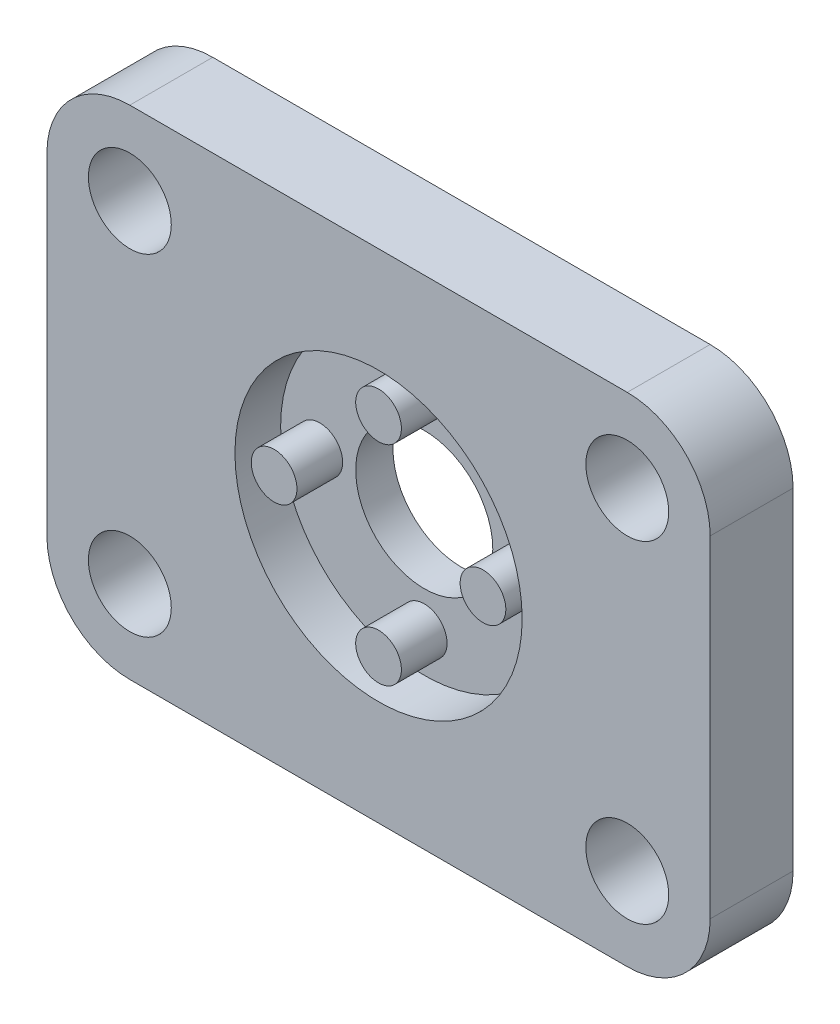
ISO-10303-21;
HEADER;
FILE_DESCRIPTION(('STEP AP214'),'2;1');
FILE_NAME('part.step','',(''),(''),'','','');
FILE_SCHEMA(('AUTOMOTIVE_DESIGN { 1 0 10303 214 1 1 1 1 }'));
ENDSEC;
DATA;
#1=APPLICATION_CONTEXT('core data for automotive mechanical design processes');
#2=APPLICATION_PROTOCOL_DEFINITION('international standard','automotive_design',2000,#1);
#3=PRODUCT_CONTEXT('',#1,'mechanical');
#4=PRODUCT('Part','Part','',(#3));
#5=PRODUCT_RELATED_PRODUCT_CATEGORY('part','',(#4));
#6=PRODUCT_DEFINITION_FORMATION('','',#4);
#7=PRODUCT_DEFINITION_CONTEXT('part definition',#1,'design');
#8=PRODUCT_DEFINITION('design','',#6,#7);
#9=PRODUCT_DEFINITION_SHAPE('','',#8);
#10=(LENGTH_UNIT() NAMED_UNIT(*) SI_UNIT(.MILLI.,.METRE.));
#11=(NAMED_UNIT(*) PLANE_ANGLE_UNIT() SI_UNIT($,.RADIAN.));
#12=(NAMED_UNIT(*) SI_UNIT($,.STERADIAN.) SOLID_ANGLE_UNIT());
#13=UNCERTAINTY_MEASURE_WITH_UNIT(LENGTH_MEASURE(1.E-05),#10,'distance_accuracy_value','');
#14=(GEOMETRIC_REPRESENTATION_CONTEXT(3) GLOBAL_UNCERTAINTY_ASSIGNED_CONTEXT((#13)) GLOBAL_UNIT_ASSIGNED_CONTEXT((#10,
#11,#12)) REPRESENTATION_CONTEXT('',''));
#15=CARTESIAN_POINT('',(0.,0.,0.));
#16=DIRECTION('',(0.,0.,1.));
#17=DIRECTION('',(1.,0.,0.));
#18=AXIS2_PLACEMENT_3D('',#15,#16,#17);
#19=CARTESIAN_POINT('',(0.,0.,6.35));
#20=DIRECTION('',(1.,0.,0.));
#21=DIRECTION('',(0.,0.,-1.));
#22=AXIS2_PLACEMENT_3D('',#19,#20,#21);
#23=PLANE('',#22);
#24=DIRECTION('',(0.,-1.,0.));
#25=VECTOR('',#24,1.);
#26=CARTESIAN_POINT('',(0.,0.,0.));
#27=LINE('',#26,#25);
#28=CARTESIAN_POINT('',(0.,31.75,0.));
#29=VERTEX_POINT('',#28);
#30=CARTESIAN_POINT('',(0.,6.35,0.));
#31=VERTEX_POINT('',#30);
#32=EDGE_CURVE('E169',#29,#31,#27,.T.);
#33=ORIENTED_EDGE('',*,*,#32,.T.);
#34=DIRECTION('',(0.,0.,-1.));
#35=VECTOR('',#34,1.);
#36=CARTESIAN_POINT('',(0.,6.35,6.35));
#37=LINE('',#36,#35);
#38=CARTESIAN_POINT('',(0.,6.35,6.35));
#39=VERTEX_POINT('',#38);
#40=EDGE_CURVE('E11',#31,#39,#37,.F.);
#41=ORIENTED_EDGE('',*,*,#40,.T.);
#42=DIRECTION('',(0.,-1.,0.));
#43=VECTOR('',#42,1.);
#44=CARTESIAN_POINT('',(0.,0.,6.35));
#45=LINE('',#44,#43);
#46=CARTESIAN_POINT('',(0.,31.75,6.35));
#47=VERTEX_POINT('',#46);
#48=EDGE_CURVE('E133',#47,#39,#45,.T.);
#49=ORIENTED_EDGE('',*,*,#48,.F.);
#50=DIRECTION('',(0.,0.,-1.));
#51=VECTOR('',#50,1.);
#52=CARTESIAN_POINT('',(0.,31.75,6.35));
#53=LINE('',#52,#51);
#54=EDGE_CURVE('E50',#47,#29,#53,.T.);
#55=ORIENTED_EDGE('',*,*,#54,.T.);
#56=EDGE_LOOP('',(#33,#41,#49,#55));
#57=FACE_BOUND('',#56,.T.);
#58=ADVANCED_FACE('F39',(#57),#23,.F.);
#59=CARTESIAN_POINT('',(0.,0.,6.35));
#60=DIRECTION('',(0.,1.,0.));
#61=DIRECTION('',(0.,0.,1.));
#62=AXIS2_PLACEMENT_3D('',#59,#60,#61);
#63=PLANE('',#62);
#64=DIRECTION('',(1.,0.,0.));
#65=VECTOR('',#64,1.);
#66=CARTESIAN_POINT('',(0.,0.,0.));
#67=LINE('',#66,#65);
#68=CARTESIAN_POINT('',(6.35,0.,0.));
#69=VERTEX_POINT('',#68);
#70=CARTESIAN_POINT('',(44.45,0.,0.));
#71=VERTEX_POINT('',#70);
#72=EDGE_CURVE('E136',#69,#71,#67,.T.);
#73=ORIENTED_EDGE('',*,*,#72,.T.);
#74=DIRECTION('',(0.,0.,-1.));
#75=VECTOR('',#74,1.);
#76=CARTESIAN_POINT('',(44.45,0.,6.35));
#77=LINE('',#76,#75);
#78=CARTESIAN_POINT('',(44.45,0.,6.35));
#79=VERTEX_POINT('',#78);
#80=EDGE_CURVE('E53',#71,#79,#77,.F.);
#81=ORIENTED_EDGE('',*,*,#80,.T.);
#82=DIRECTION('',(1.,0.,0.));
#83=VECTOR('',#82,1.);
#84=CARTESIAN_POINT('',(0.,0.,6.35));
#85=LINE('',#84,#83);
#86=CARTESIAN_POINT('',(6.35,0.,6.35));
#87=VERTEX_POINT('',#86);
#88=EDGE_CURVE('E135',#87,#79,#85,.T.);
#89=ORIENTED_EDGE('',*,*,#88,.F.);
#90=DIRECTION('',(0.,0.,-1.));
#91=VECTOR('',#90,1.);
#92=CARTESIAN_POINT('',(6.35,0.,6.35));
#93=LINE('',#92,#91);
#94=EDGE_CURVE('E159',#87,#69,#93,.T.);
#95=ORIENTED_EDGE('',*,*,#94,.T.);
#96=EDGE_LOOP('',(#73,#81,#89,#95));
#97=FACE_BOUND('',#96,.T.);
#98=ADVANCED_FACE('F254',(#97),#63,.F.);
#99=CARTESIAN_POINT('',(50.8,0.,6.35));
#100=DIRECTION('',(-1.,0.,0.));
#101=DIRECTION('',(0.,0.,1.));
#102=AXIS2_PLACEMENT_3D('',#99,#100,#101);
#103=PLANE('',#102);
#104=DIRECTION('',(0.,1.,0.));
#105=VECTOR('',#104,1.);
#106=CARTESIAN_POINT('',(50.8,0.,0.));
#107=LINE('',#106,#105);
#108=CARTESIAN_POINT('',(50.8,6.35,0.));
#109=VERTEX_POINT('',#108);
#110=CARTESIAN_POINT('',(50.8,31.75,0.));
#111=VERTEX_POINT('',#110);
#112=EDGE_CURVE('E134',#109,#111,#107,.T.);
#113=ORIENTED_EDGE('',*,*,#112,.T.);
#114=DIRECTION('',(0.,0.,-1.));
#115=VECTOR('',#114,1.);
#116=CARTESIAN_POINT('',(50.8,31.75,6.35));
#117=LINE('',#116,#115);
#118=CARTESIAN_POINT('',(50.8,31.75,6.35));
#119=VERTEX_POINT('',#118);
#120=EDGE_CURVE('E109',#111,#119,#117,.F.);
#121=ORIENTED_EDGE('',*,*,#120,.T.);
#122=DIRECTION('',(0.,1.,0.));
#123=VECTOR('',#122,1.);
#124=CARTESIAN_POINT('',(50.8,0.,6.35));
#125=LINE('',#124,#123);
#126=CARTESIAN_POINT('',(50.8,6.35,6.35));
#127=VERTEX_POINT('',#126);
#128=EDGE_CURVE('E179',#127,#119,#125,.T.);
#129=ORIENTED_EDGE('',*,*,#128,.F.);
#130=DIRECTION('',(0.,0.,-1.));
#131=VECTOR('',#130,1.);
#132=CARTESIAN_POINT('',(50.8,6.35,6.35));
#133=LINE('',#132,#131);
#134=EDGE_CURVE('E113',#127,#109,#133,.T.);
#135=ORIENTED_EDGE('',*,*,#134,.T.);
#136=EDGE_LOOP('',(#113,#121,#129,#135));
#137=FACE_BOUND('',#136,.T.);
#138=ADVANCED_FACE('F252',(#137),#103,.F.);
#139=CARTESIAN_POINT('',(0.,38.1,6.35));
#140=DIRECTION('',(0.,-1.,0.));
#141=DIRECTION('',(0.,0.,-1.));
#142=AXIS2_PLACEMENT_3D('',#139,#140,#141);
#143=PLANE('',#142);
#144=DIRECTION('',(-1.,0.,0.));
#145=VECTOR('',#144,1.);
#146=CARTESIAN_POINT('',(0.,38.1,6.35));
#147=LINE('',#146,#145);
#148=CARTESIAN_POINT('',(44.45,38.1,6.35));
#149=VERTEX_POINT('',#148);
#150=CARTESIAN_POINT('',(6.35,38.1,6.35));
#151=VERTEX_POINT('',#150);
#152=EDGE_CURVE('E124',#149,#151,#147,.T.);
#153=ORIENTED_EDGE('',*,*,#152,.F.);
#154=DIRECTION('',(0.,0.,-1.));
#155=VECTOR('',#154,1.);
#156=CARTESIAN_POINT('',(44.45,38.1,6.35));
#157=LINE('',#156,#155);
#158=CARTESIAN_POINT('',(44.45,38.1,0.));
#159=VERTEX_POINT('',#158);
#160=EDGE_CURVE('E108',#149,#159,#157,.T.);
#161=ORIENTED_EDGE('',*,*,#160,.T.);
#162=DIRECTION('',(-1.,0.,0.));
#163=VECTOR('',#162,1.);
#164=CARTESIAN_POINT('',(0.,38.1,0.));
#165=LINE('',#164,#163);
#166=CARTESIAN_POINT('',(6.35,38.1,0.));
#167=VERTEX_POINT('',#166);
#168=EDGE_CURVE('E125',#159,#167,#165,.T.);
#169=ORIENTED_EDGE('',*,*,#168,.T.);
#170=DIRECTION('',(0.,0.,-1.));
#171=VECTOR('',#170,1.);
#172=CARTESIAN_POINT('',(6.35,38.1,6.35));
#173=LINE('',#172,#171);
#174=EDGE_CURVE('E130',#167,#151,#173,.F.);
#175=ORIENTED_EDGE('',*,*,#174,.T.);
#176=EDGE_LOOP('',(#153,#161,#169,#175));
#177=FACE_BOUND('',#176,.T.);
#178=ADVANCED_FACE('F121',(#177),#143,.F.);
#179=CARTESIAN_POINT('',(0.,0.,6.35));
#180=DIRECTION('',(0.,0.,-1.));
#181=DIRECTION('',(-1.,0.,0.));
#182=AXIS2_PLACEMENT_3D('',#179,#180,#181);
#183=PLANE('',#182);
#184=CARTESIAN_POINT('',(6.35,6.35,6.35));
#185=DIRECTION('',(0.,0.,1.));
#186=DIRECTION('',(1.,0.,0.));
#187=AXIS2_PLACEMENT_3D('',#184,#185,#186);
#188=CIRCLE('',#187,3.175);
#189=CARTESIAN_POINT('',(9.525,6.35,6.35));
#190=VERTEX_POINT('',#189);
#191=EDGE_CURVE('E214',#190,#190,#188,.T.);
#192=ORIENTED_EDGE('',*,*,#191,.F.);
#193=EDGE_LOOP('',(#192));
#194=FACE_BOUND('',#193,.T.);
#195=CARTESIAN_POINT('',(44.45,31.75,6.35));
#196=DIRECTION('',(0.,0.,1.));
#197=DIRECTION('',(1.,0.,0.));
#198=AXIS2_PLACEMENT_3D('',#195,#196,#197);
#199=CIRCLE('',#198,3.175);
#200=CARTESIAN_POINT('',(47.625,31.75,6.35));
#201=VERTEX_POINT('',#200);
#202=EDGE_CURVE('E222',#201,#201,#199,.T.);
#203=ORIENTED_EDGE('',*,*,#202,.F.);
#204=EDGE_LOOP('',(#203));
#205=FACE_BOUND('',#204,.T.);
#206=CARTESIAN_POINT('',(44.45,6.35,6.35));
#207=DIRECTION('',(0.,0.,1.));
#208=DIRECTION('',(1.,0.,0.));
#209=AXIS2_PLACEMENT_3D('',#206,#207,#208);
#210=CIRCLE('',#209,3.175);
#211=CARTESIAN_POINT('',(47.625,6.35,6.35));
#212=VERTEX_POINT('',#211);
#213=EDGE_CURVE('E225',#212,#212,#210,.T.);
#214=ORIENTED_EDGE('',*,*,#213,.F.);
#215=EDGE_LOOP('',(#214));
#216=FACE_BOUND('',#215,.T.);
#217=CARTESIAN_POINT('',(6.35,31.75,6.35));
#218=DIRECTION('',(0.,0.,1.));
#219=DIRECTION('',(1.,0.,0.));
#220=AXIS2_PLACEMENT_3D('',#217,#218,#219);
#221=CIRCLE('',#220,3.175);
#222=CARTESIAN_POINT('',(9.525,31.75,6.35));
#223=VERTEX_POINT('',#222);
#224=EDGE_CURVE('E215',#223,#223,#221,.T.);
#225=ORIENTED_EDGE('',*,*,#224,.F.);
#226=EDGE_LOOP('',(#225));
#227=FACE_BOUND('',#226,.T.);
#228=CARTESIAN_POINT('',(25.4,19.05,6.35));
#229=DIRECTION('',(0.,0.,1.));
#230=DIRECTION('',(1.,0.,0.));
#231=AXIS2_PLACEMENT_3D('',#228,#229,#230);
#232=CIRCLE('',#231,11.);
#233=CARTESIAN_POINT('',(36.4,19.05,6.35));
#234=VERTEX_POINT('',#233);
#235=EDGE_CURVE('E176',#234,#234,#232,.T.);
#236=ORIENTED_EDGE('',*,*,#235,.F.);
#237=EDGE_LOOP('',(#236));
#238=FACE_BOUND('',#237,.T.);
#239=ORIENTED_EDGE('',*,*,#128,.T.);
#240=CARTESIAN_POINT('',(44.45,31.75,6.35));
#241=DIRECTION('',(0.,0.,-1.));
#242=DIRECTION('',(-1.,0.,0.));
#243=AXIS2_PLACEMENT_3D('',#240,#241,#242);
#244=CIRCLE('',#243,6.35);
#245=EDGE_CURVE('E158',#119,#149,#244,.F.);
#246=ORIENTED_EDGE('',*,*,#245,.T.);
#247=ORIENTED_EDGE('',*,*,#152,.T.);
#248=CARTESIAN_POINT('',(6.35,31.75,6.35));
#249=DIRECTION('',(0.,0.,-1.));
#250=DIRECTION('',(-1.,0.,0.));
#251=AXIS2_PLACEMENT_3D('',#248,#249,#250);
#252=CIRCLE('',#251,6.35);
#253=EDGE_CURVE('E153',#151,#47,#252,.F.);
#254=ORIENTED_EDGE('',*,*,#253,.T.);
#255=ORIENTED_EDGE('',*,*,#48,.T.);
#256=CARTESIAN_POINT('',(6.35,6.35,6.35));
#257=DIRECTION('',(0.,0.,-1.));
#258=DIRECTION('',(-1.,0.,0.));
#259=AXIS2_PLACEMENT_3D('',#256,#257,#258);
#260=CIRCLE('',#259,6.35);
#261=EDGE_CURVE('E63',#39,#87,#260,.F.);
#262=ORIENTED_EDGE('',*,*,#261,.T.);
#263=ORIENTED_EDGE('',*,*,#88,.T.);
#264=CARTESIAN_POINT('',(44.45,6.35,6.35));
#265=DIRECTION('',(0.,0.,-1.));
#266=DIRECTION('',(-1.,0.,0.));
#267=AXIS2_PLACEMENT_3D('',#264,#265,#266);
#268=CIRCLE('',#267,6.35);
#269=EDGE_CURVE('E156',#79,#127,#268,.F.);
#270=ORIENTED_EDGE('',*,*,#269,.T.);
#271=EDGE_LOOP('',(#239,#246,#247,#254,#255,#262,#263,#270));
#272=FACE_BOUND('',#271,.T.);
#273=ADVANCED_FACE('F236',(#194,#205,#216,#227,#238,#272),#183,.F.);
#274=CARTESIAN_POINT('',(0.,0.,0.));
#275=DIRECTION('',(0.,0.,-1.));
#276=DIRECTION('',(-1.,0.,0.));
#277=AXIS2_PLACEMENT_3D('',#274,#275,#276);
#278=PLANE('',#277);
#279=CARTESIAN_POINT('',(6.35,6.35,0.));
#280=DIRECTION('',(0.,0.,1.));
#281=DIRECTION('',(1.,0.,0.));
#282=AXIS2_PLACEMENT_3D('',#279,#280,#281);
#283=CIRCLE('',#282,3.175);
#284=CARTESIAN_POINT('',(9.525,6.35,0.));
#285=VERTEX_POINT('',#284);
#286=EDGE_CURVE('E223',#285,#285,#283,.T.);
#287=ORIENTED_EDGE('',*,*,#286,.T.);
#288=EDGE_LOOP('',(#287));
#289=FACE_BOUND('',#288,.T.);
#290=CARTESIAN_POINT('',(44.45,31.75,0.));
#291=DIRECTION('',(0.,0.,1.));
#292=DIRECTION('',(1.,0.,0.));
#293=AXIS2_PLACEMENT_3D('',#290,#291,#292);
#294=CIRCLE('',#293,3.175);
#295=CARTESIAN_POINT('',(47.625,31.75,0.));
#296=VERTEX_POINT('',#295);
#297=EDGE_CURVE('E217',#296,#296,#294,.T.);
#298=ORIENTED_EDGE('',*,*,#297,.T.);
#299=EDGE_LOOP('',(#298));
#300=FACE_BOUND('',#299,.T.);
#301=CARTESIAN_POINT('',(44.45,6.35,0.));
#302=DIRECTION('',(0.,0.,1.));
#303=DIRECTION('',(1.,0.,0.));
#304=AXIS2_PLACEMENT_3D('',#301,#302,#303);
#305=CIRCLE('',#304,3.175);
#306=CARTESIAN_POINT('',(47.625,6.35,0.));
#307=VERTEX_POINT('',#306);
#308=EDGE_CURVE('E226',#307,#307,#305,.T.);
#309=ORIENTED_EDGE('',*,*,#308,.T.);
#310=EDGE_LOOP('',(#309));
#311=FACE_BOUND('',#310,.T.);
#312=CARTESIAN_POINT('',(6.35,31.75,0.));
#313=DIRECTION('',(0.,0.,1.));
#314=DIRECTION('',(1.,0.,0.));
#315=AXIS2_PLACEMENT_3D('',#312,#313,#314);
#316=CIRCLE('',#315,3.175);
#317=CARTESIAN_POINT('',(9.525,31.75,0.));
#318=VERTEX_POINT('',#317);
#319=EDGE_CURVE('E211',#318,#318,#316,.T.);
#320=ORIENTED_EDGE('',*,*,#319,.T.);
#321=EDGE_LOOP('',(#320));
#322=FACE_BOUND('',#321,.T.);
#323=CARTESIAN_POINT('',(25.4,19.05,0.));
#324=DIRECTION('',(0.,0.,-1.));
#325=DIRECTION('',(-1.,0.,0.));
#326=AXIS2_PLACEMENT_3D('',#323,#324,#325);
#327=CIRCLE('',#326,5.25);
#328=CARTESIAN_POINT('',(20.15,19.05,0.));
#329=VERTEX_POINT('',#328);
#330=EDGE_CURVE('E139',#329,#329,#327,.T.);
#331=ORIENTED_EDGE('',*,*,#330,.F.);
#332=EDGE_LOOP('',(#331));
#333=FACE_BOUND('',#332,.T.);
#334=ORIENTED_EDGE('',*,*,#168,.F.);
#335=CARTESIAN_POINT('',(44.45,31.75,0.));
#336=DIRECTION('',(0.,0.,-1.));
#337=DIRECTION('',(-1.,0.,0.));
#338=AXIS2_PLACEMENT_3D('',#335,#336,#337);
#339=CIRCLE('',#338,6.35);
#340=EDGE_CURVE('E104',#159,#111,#339,.T.);
#341=ORIENTED_EDGE('',*,*,#340,.T.);
#342=ORIENTED_EDGE('',*,*,#112,.F.);
#343=CARTESIAN_POINT('',(44.45,6.35,0.));
#344=DIRECTION('',(0.,0.,-1.));
#345=DIRECTION('',(-1.,0.,0.));
#346=AXIS2_PLACEMENT_3D('',#343,#344,#345);
#347=CIRCLE('',#346,6.35);
#348=EDGE_CURVE('E118',#109,#71,#347,.T.);
#349=ORIENTED_EDGE('',*,*,#348,.T.);
#350=ORIENTED_EDGE('',*,*,#72,.F.);
#351=CARTESIAN_POINT('',(6.35,6.35,0.));
#352=DIRECTION('',(0.,0.,-1.));
#353=DIRECTION('',(-1.,0.,0.));
#354=AXIS2_PLACEMENT_3D('',#351,#352,#353);
#355=CIRCLE('',#354,6.35);
#356=EDGE_CURVE('E150',#69,#31,#355,.T.);
#357=ORIENTED_EDGE('',*,*,#356,.T.);
#358=ORIENTED_EDGE('',*,*,#32,.F.);
#359=CARTESIAN_POINT('',(6.35,31.75,0.));
#360=DIRECTION('',(0.,0.,-1.));
#361=DIRECTION('',(-1.,0.,0.));
#362=AXIS2_PLACEMENT_3D('',#359,#360,#361);
#363=CIRCLE('',#362,6.35);
#364=EDGE_CURVE('E127',#29,#167,#363,.T.);
#365=ORIENTED_EDGE('',*,*,#364,.T.);
#366=EDGE_LOOP('',(#334,#341,#342,#349,#350,#357,#358,#365));
#367=FACE_BOUND('',#366,.T.);
#368=ADVANCED_FACE('F129',(#289,#300,#311,#322,#333,#367),#278,.T.);
#369=CARTESIAN_POINT('',(25.4,19.05,2.85));
#370=DIRECTION('',(0.,0.,1.));
#371=DIRECTION('',(1.,0.,0.));
#372=AXIS2_PLACEMENT_3D('',#369,#370,#371);
#373=CYLINDRICAL_SURFACE('',#372,11.);
#374=CARTESIAN_POINT('',(25.4,19.05,2.85));
#375=DIRECTION('',(0.,0.,1.));
#376=DIRECTION('',(1.,0.,0.));
#377=AXIS2_PLACEMENT_3D('',#374,#375,#376);
#378=CIRCLE('',#377,11.);
#379=CARTESIAN_POINT('',(36.4,19.05,2.85));
#380=VERTEX_POINT('',#379);
#381=EDGE_CURVE('E172',#380,#380,#378,.T.);
#382=ORIENTED_EDGE('',*,*,#381,.F.);
#383=EDGE_LOOP('',(#382));
#384=FACE_BOUND('',#383,.T.);
#385=ORIENTED_EDGE('',*,*,#235,.T.);
#386=EDGE_LOOP('',(#385));
#387=FACE_BOUND('',#386,.T.);
#388=ADVANCED_FACE('F383',(#384,#387),#373,.F.);
#389=CARTESIAN_POINT('',(25.4,19.05,2.85));
#390=DIRECTION('',(0.,0.,1.));
#391=DIRECTION('',(1.,0.,0.));
#392=AXIS2_PLACEMENT_3D('',#389,#390,#391);
#393=PLANE('',#392);
#394=CARTESIAN_POINT('',(25.4,19.05,2.85));
#395=DIRECTION('',(0.,0.,1.));
#396=DIRECTION('',(1.,0.,0.));
#397=AXIS2_PLACEMENT_3D('',#394,#395,#396);
#398=CIRCLE('',#397,5.25);
#399=CARTESIAN_POINT('',(30.65,19.05,2.85));
#400=VERTEX_POINT('',#399);
#401=EDGE_CURVE('E145',#400,#400,#398,.T.);
#402=ORIENTED_EDGE('',*,*,#401,.F.);
#403=EDGE_LOOP('',(#402));
#404=FACE_BOUND('',#403,.T.);
#405=CARTESIAN_POINT('',(17.4,19.05,2.85));
#406=DIRECTION('',(0.,0.,1.));
#407=DIRECTION('',(1.,0.,0.));
#408=AXIS2_PLACEMENT_3D('',#405,#406,#407);
#409=CIRCLE('',#408,1.75);
#410=CARTESIAN_POINT('',(19.15,19.05,2.85));
#411=VERTEX_POINT('',#410);
#412=EDGE_CURVE('E205',#411,#411,#409,.T.);
#413=ORIENTED_EDGE('',*,*,#412,.F.);
#414=EDGE_LOOP('',(#413));
#415=FACE_BOUND('',#414,.T.);
#416=CARTESIAN_POINT('',(25.4,11.05,2.85));
#417=DIRECTION('',(0.,0.,1.));
#418=DIRECTION('',(1.,0.,0.));
#419=AXIS2_PLACEMENT_3D('',#416,#417,#418);
#420=CIRCLE('',#419,1.75);
#421=CARTESIAN_POINT('',(27.15,11.05,2.85));
#422=VERTEX_POINT('',#421);
#423=EDGE_CURVE('E198',#422,#422,#420,.T.);
#424=ORIENTED_EDGE('',*,*,#423,.F.);
#425=EDGE_LOOP('',(#424));
#426=FACE_BOUND('',#425,.T.);
#427=CARTESIAN_POINT('',(33.4,19.05,2.85));
#428=DIRECTION('',(0.,0.,1.));
#429=DIRECTION('',(1.,0.,0.));
#430=AXIS2_PLACEMENT_3D('',#427,#428,#429);
#431=CIRCLE('',#430,1.75);
#432=CARTESIAN_POINT('',(35.15,19.05,2.85));
#433=VERTEX_POINT('',#432);
#434=EDGE_CURVE('E186',#433,#433,#431,.T.);
#435=ORIENTED_EDGE('',*,*,#434,.F.);
#436=EDGE_LOOP('',(#435));
#437=FACE_BOUND('',#436,.T.);
#438=CARTESIAN_POINT('',(25.4,27.05,2.85));
#439=DIRECTION('',(0.,0.,1.));
#440=DIRECTION('',(1.,0.,0.));
#441=AXIS2_PLACEMENT_3D('',#438,#439,#440);
#442=CIRCLE('',#441,1.75);
#443=CARTESIAN_POINT('',(27.15,27.05,2.85));
#444=VERTEX_POINT('',#443);
#445=EDGE_CURVE('E183',#444,#444,#442,.T.);
#446=ORIENTED_EDGE('',*,*,#445,.F.);
#447=EDGE_LOOP('',(#446));
#448=FACE_BOUND('',#447,.T.);
#449=ORIENTED_EDGE('',*,*,#381,.T.);
#450=EDGE_LOOP('',(#449));
#451=FACE_BOUND('',#450,.T.);
#452=ADVANCED_FACE('F374',(#404,#415,#426,#437,#448,#451),#393,.T.);
#453=CARTESIAN_POINT('',(25.4,27.05,2.85));
#454=DIRECTION('',(0.,0.,1.));
#455=DIRECTION('',(1.,0.,0.));
#456=AXIS2_PLACEMENT_3D('',#453,#454,#455);
#457=CYLINDRICAL_SURFACE('',#456,1.75);
#458=ORIENTED_EDGE('',*,*,#445,.T.);
#459=EDGE_LOOP('',(#458));
#460=FACE_BOUND('',#459,.T.);
#461=CARTESIAN_POINT('',(25.4,27.05,6.35));
#462=DIRECTION('',(0.,0.,1.));
#463=DIRECTION('',(1.,0.,0.));
#464=AXIS2_PLACEMENT_3D('',#461,#462,#463);
#465=CIRCLE('',#464,1.75);
#466=CARTESIAN_POINT('',(27.15,27.05,6.35));
#467=VERTEX_POINT('',#466);
#468=EDGE_CURVE('E189',#467,#467,#465,.T.);
#469=ORIENTED_EDGE('',*,*,#468,.F.);
#470=EDGE_LOOP('',(#469));
#471=FACE_BOUND('',#470,.T.);
#472=ADVANCED_FACE('F368',(#460,#471),#457,.T.);
#473=CARTESIAN_POINT('',(33.4,19.05,2.85));
#474=DIRECTION('',(0.,0.,1.));
#475=DIRECTION('',(1.,0.,0.));
#476=AXIS2_PLACEMENT_3D('',#473,#474,#475);
#477=CYLINDRICAL_SURFACE('',#476,1.75);
#478=ORIENTED_EDGE('',*,*,#434,.T.);
#479=EDGE_LOOP('',(#478));
#480=FACE_BOUND('',#479,.T.);
#481=CARTESIAN_POINT('',(33.4,19.05,6.35));
#482=DIRECTION('',(0.,0.,1.));
#483=DIRECTION('',(1.,0.,0.));
#484=AXIS2_PLACEMENT_3D('',#481,#482,#483);
#485=CIRCLE('',#484,1.75);
#486=CARTESIAN_POINT('',(35.15,19.05,6.35));
#487=VERTEX_POINT('',#486);
#488=EDGE_CURVE('E192',#487,#487,#485,.T.);
#489=ORIENTED_EDGE('',*,*,#488,.F.);
#490=EDGE_LOOP('',(#489));
#491=FACE_BOUND('',#490,.T.);
#492=ADVANCED_FACE('F360',(#480,#491),#477,.T.);
#493=CARTESIAN_POINT('',(25.4,11.05,2.85));
#494=DIRECTION('',(0.,0.,1.));
#495=DIRECTION('',(1.,0.,0.));
#496=AXIS2_PLACEMENT_3D('',#493,#494,#495);
#497=CYLINDRICAL_SURFACE('',#496,1.75);
#498=ORIENTED_EDGE('',*,*,#423,.T.);
#499=EDGE_LOOP('',(#498));
#500=FACE_BOUND('',#499,.T.);
#501=CARTESIAN_POINT('',(25.4,11.05,6.35));
#502=DIRECTION('',(0.,0.,1.));
#503=DIRECTION('',(1.,0.,0.));
#504=AXIS2_PLACEMENT_3D('',#501,#502,#503);
#505=CIRCLE('',#504,1.75);
#506=CARTESIAN_POINT('',(27.15,11.05,6.35));
#507=VERTEX_POINT('',#506);
#508=EDGE_CURVE('E200',#507,#507,#505,.T.);
#509=ORIENTED_EDGE('',*,*,#508,.F.);
#510=EDGE_LOOP('',(#509));
#511=FACE_BOUND('',#510,.T.);
#512=ADVANCED_FACE('F346',(#500,#511),#497,.T.);
#513=CARTESIAN_POINT('',(17.4,19.05,2.85));
#514=DIRECTION('',(0.,0.,1.));
#515=DIRECTION('',(1.,0.,0.));
#516=AXIS2_PLACEMENT_3D('',#513,#514,#515);
#517=CYLINDRICAL_SURFACE('',#516,1.75);
#518=ORIENTED_EDGE('',*,*,#412,.T.);
#519=EDGE_LOOP('',(#518));
#520=FACE_BOUND('',#519,.T.);
#521=CARTESIAN_POINT('',(17.4,19.05,6.35));
#522=DIRECTION('',(0.,0.,1.));
#523=DIRECTION('',(1.,0.,0.));
#524=AXIS2_PLACEMENT_3D('',#521,#522,#523);
#525=CIRCLE('',#524,1.75);
#526=CARTESIAN_POINT('',(19.15,19.05,6.35));
#527=VERTEX_POINT('',#526);
#528=EDGE_CURVE('E141',#527,#527,#525,.T.);
#529=ORIENTED_EDGE('',*,*,#528,.F.);
#530=EDGE_LOOP('',(#529));
#531=FACE_BOUND('',#530,.T.);
#532=ADVANCED_FACE('F342',(#520,#531),#517,.T.);
#533=ORIENTED_EDGE('',*,*,#508,.T.);
#534=EDGE_LOOP('',(#533));
#535=FACE_BOUND('',#534,.T.);
#536=ADVANCED_FACE('F350',(#535),#183,.F.);
#537=ORIENTED_EDGE('',*,*,#488,.T.);
#538=EDGE_LOOP('',(#537));
#539=FACE_BOUND('',#538,.T.);
#540=ADVANCED_FACE('F402',(#539),#183,.F.);
#541=ORIENTED_EDGE('',*,*,#468,.T.);
#542=EDGE_LOOP('',(#541));
#543=FACE_BOUND('',#542,.T.);
#544=ADVANCED_FACE('F242',(#543),#183,.F.);
#545=ORIENTED_EDGE('',*,*,#528,.T.);
#546=EDGE_LOOP('',(#545));
#547=FACE_BOUND('',#546,.T.);
#548=ADVANCED_FACE('F245',(#547),#183,.F.);
#549=CARTESIAN_POINT('',(25.4,19.05,-0.65));
#550=DIRECTION('',(0.,0.,1.));
#551=DIRECTION('',(1.,0.,0.));
#552=AXIS2_PLACEMENT_3D('',#549,#550,#551);
#553=CYLINDRICAL_SURFACE('',#552,5.25);
#554=ORIENTED_EDGE('',*,*,#330,.T.);
#555=EDGE_LOOP('',(#554));
#556=FACE_BOUND('',#555,.T.);
#557=ORIENTED_EDGE('',*,*,#401,.T.);
#558=EDGE_LOOP('',(#557));
#559=FACE_BOUND('',#558,.T.);
#560=ADVANCED_FACE('F328',(#556,#559),#553,.F.);
#561=CARTESIAN_POINT('',(6.35,31.75,0.));
#562=DIRECTION('',(0.,0.,1.));
#563=DIRECTION('',(1.,0.,0.));
#564=AXIS2_PLACEMENT_3D('',#561,#562,#563);
#565=CYLINDRICAL_SURFACE('',#564,3.175);
#566=ORIENTED_EDGE('',*,*,#319,.F.);
#567=EDGE_LOOP('',(#566));
#568=FACE_BOUND('',#567,.T.);
#569=ORIENTED_EDGE('',*,*,#224,.T.);
#570=EDGE_LOOP('',(#569));
#571=FACE_BOUND('',#570,.T.);
#572=ADVANCED_FACE('F319',(#568,#571),#565,.F.);
#573=CARTESIAN_POINT('',(44.45,6.35,0.));
#574=DIRECTION('',(0.,0.,1.));
#575=DIRECTION('',(1.,0.,0.));
#576=AXIS2_PLACEMENT_3D('',#573,#574,#575);
#577=CYLINDRICAL_SURFACE('',#576,3.175);
#578=ORIENTED_EDGE('',*,*,#308,.F.);
#579=EDGE_LOOP('',(#578));
#580=FACE_BOUND('',#579,.T.);
#581=ORIENTED_EDGE('',*,*,#213,.T.);
#582=EDGE_LOOP('',(#581));
#583=FACE_BOUND('',#582,.T.);
#584=ADVANCED_FACE('F237',(#580,#583),#577,.F.);
#585=CARTESIAN_POINT('',(44.45,31.75,0.));
#586=DIRECTION('',(0.,0.,1.));
#587=DIRECTION('',(1.,0.,0.));
#588=AXIS2_PLACEMENT_3D('',#585,#586,#587);
#589=CYLINDRICAL_SURFACE('',#588,3.175);
#590=ORIENTED_EDGE('',*,*,#297,.F.);
#591=EDGE_LOOP('',(#590));
#592=FACE_BOUND('',#591,.T.);
#593=ORIENTED_EDGE('',*,*,#202,.T.);
#594=EDGE_LOOP('',(#593));
#595=FACE_BOUND('',#594,.T.);
#596=ADVANCED_FACE('F302',(#592,#595),#589,.F.);
#597=CARTESIAN_POINT('',(6.35,6.35,0.));
#598=DIRECTION('',(0.,0.,1.));
#599=DIRECTION('',(1.,0.,0.));
#600=AXIS2_PLACEMENT_3D('',#597,#598,#599);
#601=CYLINDRICAL_SURFACE('',#600,3.175);
#602=ORIENTED_EDGE('',*,*,#286,.F.);
#603=EDGE_LOOP('',(#602));
#604=FACE_BOUND('',#603,.T.);
#605=ORIENTED_EDGE('',*,*,#191,.T.);
#606=EDGE_LOOP('',(#605));
#607=FACE_BOUND('',#606,.T.);
#608=ADVANCED_FACE('F273',(#604,#607),#601,.F.);
#609=CARTESIAN_POINT('',(44.45,31.75,6.35));
#610=DIRECTION('',(0.,0.,-1.));
#611=DIRECTION('',(-1.,0.,0.));
#612=AXIS2_PLACEMENT_3D('',#609,#610,#611);
#613=CYLINDRICAL_SURFACE('',#612,6.35);
#614=ORIENTED_EDGE('',*,*,#245,.F.);
#615=ORIENTED_EDGE('',*,*,#120,.F.);
#616=ORIENTED_EDGE('',*,*,#340,.F.);
#617=ORIENTED_EDGE('',*,*,#160,.F.);
#618=EDGE_LOOP('',(#614,#615,#616,#617));
#619=FACE_BOUND('',#618,.T.);
#620=ADVANCED_FACE('F107',(#619),#613,.T.);
#621=CARTESIAN_POINT('',(44.45,6.35,6.35));
#622=DIRECTION('',(0.,0.,-1.));
#623=DIRECTION('',(-1.,0.,0.));
#624=AXIS2_PLACEMENT_3D('',#621,#622,#623);
#625=CYLINDRICAL_SURFACE('',#624,6.35);
#626=ORIENTED_EDGE('',*,*,#269,.F.);
#627=ORIENTED_EDGE('',*,*,#80,.F.);
#628=ORIENTED_EDGE('',*,*,#348,.F.);
#629=ORIENTED_EDGE('',*,*,#134,.F.);
#630=EDGE_LOOP('',(#626,#627,#628,#629));
#631=FACE_BOUND('',#630,.T.);
#632=ADVANCED_FACE('F255',(#631),#625,.T.);
#633=CARTESIAN_POINT('',(6.35,6.35,6.35));
#634=DIRECTION('',(0.,0.,-1.));
#635=DIRECTION('',(-1.,0.,0.));
#636=AXIS2_PLACEMENT_3D('',#633,#634,#635);
#637=CYLINDRICAL_SURFACE('',#636,6.35);
#638=ORIENTED_EDGE('',*,*,#261,.F.);
#639=ORIENTED_EDGE('',*,*,#40,.F.);
#640=ORIENTED_EDGE('',*,*,#356,.F.);
#641=ORIENTED_EDGE('',*,*,#94,.F.);
#642=EDGE_LOOP('',(#638,#639,#640,#641));
#643=FACE_BOUND('',#642,.T.);
#644=ADVANCED_FACE('F256',(#643),#637,.T.);
#645=CARTESIAN_POINT('',(6.35,31.75,6.35));
#646=DIRECTION('',(0.,0.,-1.));
#647=DIRECTION('',(-1.,0.,0.));
#648=AXIS2_PLACEMENT_3D('',#645,#646,#647);
#649=CYLINDRICAL_SURFACE('',#648,6.35);
#650=ORIENTED_EDGE('',*,*,#253,.F.);
#651=ORIENTED_EDGE('',*,*,#174,.F.);
#652=ORIENTED_EDGE('',*,*,#364,.F.);
#653=ORIENTED_EDGE('',*,*,#54,.F.);
#654=EDGE_LOOP('',(#650,#651,#652,#653));
#655=FACE_BOUND('',#654,.T.);
#656=ADVANCED_FACE('F41',(#655),#649,.T.);
#657=CLOSED_SHELL('',(#58,#98,#138,#178,#273,#368,#388,#452,#472,#492,#512,#532,#536,#540,#544,
#548,#560,#572,#584,#596,#608,#620,#632,#644,#656));
#658=MANIFOLD_SOLID_BREP('B2',#657);
#659=ADVANCED_BREP_SHAPE_REPRESENTATION('',(#18,#658),#14);
#660=SHAPE_DEFINITION_REPRESENTATION(#9,#659);
ENDSEC;
END-ISO-10303-21;
